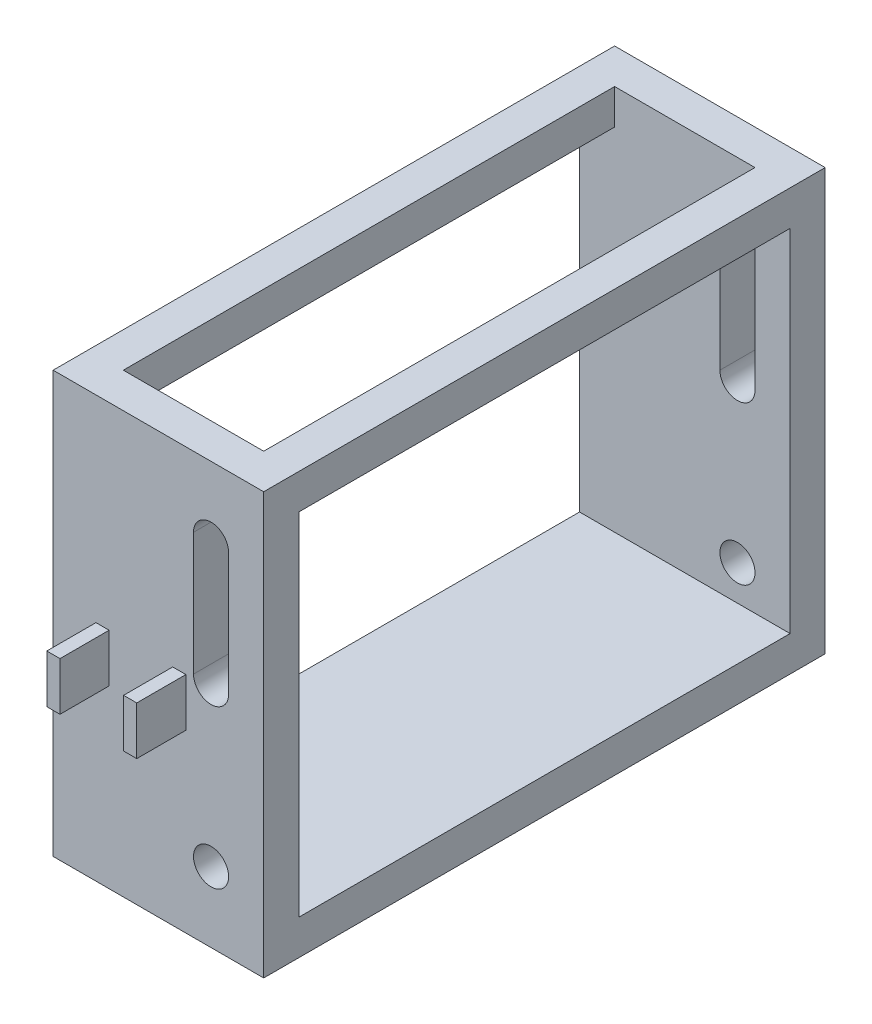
from build123d import *

# Parameters (mm, degrees)
SKETCH1_W           = 76.2
SKETCH1_H           = 203.2
BOSS_EXTRUDE1_DEPTH = 12.7
SKETCH2_W           = 76.2
SKETCH2_H           = 12.7
BOSS_EXTRUDE2_DEPTH = 127
SKETCH3_W           = 76.2
SKETCH3_H           = 203.2
SKETCH3_W_2         = 50.8
SKETCH3_H_2         = 177.8
BOSS_EXTRUDE3_DEPTH = 12.7
SKETCH4_R           = 6.35
CUT_EXTRUDE1_DEPTH  = 266.183785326
SKETCH6_W           = 4.7625
SKETCH6_H           = 17.4625
BOSS_EXTRUDE4_DEPTH = 17.78


with BuildPart() as part:
    # Sketch1 → Boss-Extrude1 (new body)
    with BuildSketch(Plane(origin=(0, 0, 0), x_dir=(1, 0, 0), z_dir=(0, 1, 0))):
        with Locations((38.1, 101.6)):
            Rectangle(SKETCH1_W, SKETCH1_H)
    extrude(amount=BOSS_EXTRUDE1_DEPTH)

    # Sketch2 → Boss-Extrude2 (add)
    with BuildSketch(Plane(origin=(0, 12.7, 0), x_dir=(1, 0, 0), z_dir=(0, 1, 0))):
        with Locations((38.1, 196.85)):
            Rectangle(SKETCH2_W, SKETCH2_H)
        with Locations((38.1, 6.35)):
            Rectangle(SKETCH2_W, SKETCH2_H)
    extrude(amount=BOSS_EXTRUDE2_DEPTH)

    # Sketch3 → Boss-Extrude3 (add)
    with BuildSketch(Plane(origin=(0, 139.7, 0), x_dir=(1, 0, 0), z_dir=(0, 1, 0))):
        with Locations((38.1, 101.6)):
            Rectangle(SKETCH3_W, SKETCH3_H)
        with Locations((38.1, 101.6)):
            Rectangle(SKETCH3_W_2, SKETCH3_H_2, mode=Mode.SUBTRACT)
    extrude(amount=BOSS_EXTRUDE3_DEPTH)

    # Sketch4 → Cut-Extrude1 (cut, through all)
    with BuildSketch(Plane.XY):
        with Locations((57.15, 25.4)):
            Circle(SKETCH4_R)
        with BuildLine():
            Line((50.8, 127), (50.8, 82.55))
            ThreePointArc((50.8, 82.55), (57.15, 76.2), (63.5, 82.55))
            Line((63.5, 82.55), (63.5, 127))
            ThreePointArc((63.5, 127), (57.15, 133.35), (50.8, 127))
        make_face()
    extrude(amount=-CUT_EXTRUDE1_DEPTH, mode=Mode.SUBTRACT)

    # Sketch6 → Boss-Extrude4 (add)
    with BuildSketch(Plane.XY):
        with Locations((17.87525, 72.29475)):
            Rectangle(SKETCH6_W, SKETCH6_H)
        with Locations((45.6565, 72.29475)):
            Rectangle(SKETCH6_W, SKETCH6_H)
    boss_extrude4 = extrude(amount=BOSS_EXTRUDE4_DEPTH)

    # Mirror1: Boss-Extrude4 across plane
    add(boss_extrude4.mirror(Plane.XY.offset(-101.6)))


solid = part.part
